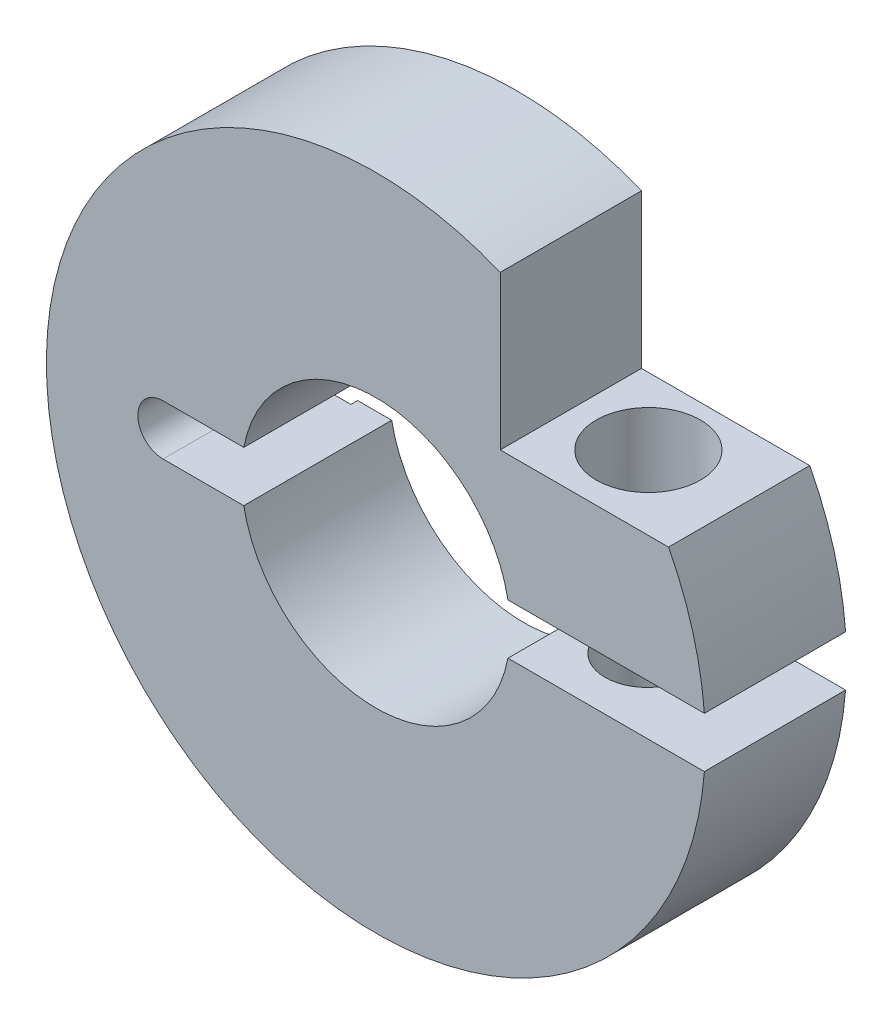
ISO-10303-21;
HEADER;
FILE_DESCRIPTION(('STEP AP214'),'2;1');
FILE_NAME('part.step','',(''),(''),'','','');
FILE_SCHEMA(('AUTOMOTIVE_DESIGN { 1 0 10303 214 1 1 1 1 }'));
ENDSEC;
DATA;
#1=APPLICATION_CONTEXT('core data for automotive mechanical design processes');
#2=APPLICATION_PROTOCOL_DEFINITION('international standard','automotive_design',2000,#1);
#3=PRODUCT_CONTEXT('',#1,'mechanical');
#4=PRODUCT('Part','Part','',(#3));
#5=PRODUCT_RELATED_PRODUCT_CATEGORY('part','',(#4));
#6=PRODUCT_DEFINITION_FORMATION('','',#4);
#7=PRODUCT_DEFINITION_CONTEXT('part definition',#1,'design');
#8=PRODUCT_DEFINITION('design','',#6,#7);
#9=PRODUCT_DEFINITION_SHAPE('','',#8);
#10=(LENGTH_UNIT() NAMED_UNIT(*) SI_UNIT(.MILLI.,.METRE.));
#11=(NAMED_UNIT(*) PLANE_ANGLE_UNIT() SI_UNIT($,.RADIAN.));
#12=(NAMED_UNIT(*) SI_UNIT($,.STERADIAN.) SOLID_ANGLE_UNIT());
#13=UNCERTAINTY_MEASURE_WITH_UNIT(LENGTH_MEASURE(1.E-05),#10,'distance_accuracy_value','');
#14=(GEOMETRIC_REPRESENTATION_CONTEXT(3) GLOBAL_UNCERTAINTY_ASSIGNED_CONTEXT((#13)) GLOBAL_UNIT_ASSIGNED_CONTEXT((#10,
#11,#12)) REPRESENTATION_CONTEXT('',''));
#15=CARTESIAN_POINT('',(0.,0.,0.));
#16=DIRECTION('',(0.,0.,1.));
#17=DIRECTION('',(1.,0.,0.));
#18=AXIS2_PLACEMENT_3D('',#15,#16,#17);
#19=CARTESIAN_POINT('',(3.7,4.5,2.2));
#20=DIRECTION('',(0.,-1.,0.));
#21=DIRECTION('',(1.,0.,0.));
#22=AXIS2_PLACEMENT_3D('',#19,#20,#21);
#23=PLANE('',#22);
#24=CARTESIAN_POINT('',(5.90574522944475,4.5,0.));
#25=DIRECTION('',(0.,1.,0.));
#26=DIRECTION('',(0.,0.,1.));
#27=AXIS2_PLACEMENT_3D('',#24,#25,#26);
#28=CIRCLE('',#27,1.54999999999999);
#29=CARTESIAN_POINT('',(5.90574522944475,4.5,1.54999999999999));
#30=VERTEX_POINT('',#29);
#31=EDGE_CURVE('E207',#30,#30,#28,.T.);
#32=ORIENTED_EDGE('',*,*,#31,.F.);
#33=EDGE_LOOP('',(#32));
#34=FACE_BOUND('',#33,.T.);
#35=DIRECTION('',(1.,0.,0.));
#36=VECTOR('',#35,1.);
#37=CARTESIAN_POINT('',(3.7,4.5,-2.));
#38=LINE('',#37,#36);
#39=CARTESIAN_POINT('',(3.7,4.5,-2.));
#40=VERTEX_POINT('',#39);
#41=CARTESIAN_POINT('',(8.70574522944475,4.49999999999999,-2.));
#42=VERTEX_POINT('',#41);
#43=EDGE_CURVE('E190',#40,#42,#38,.T.);
#44=ORIENTED_EDGE('',*,*,#43,.F.);
#45=DIRECTION('',(0.,0.,-1.));
#46=VECTOR('',#45,1.);
#47=CARTESIAN_POINT('',(3.7,4.5,2.2));
#48=LINE('',#47,#46);
#49=CARTESIAN_POINT('',(3.7,4.5,2.2));
#50=VERTEX_POINT('',#49);
#51=EDGE_CURVE('E303',#50,#40,#48,.T.);
#52=ORIENTED_EDGE('',*,*,#51,.F.);
#53=DIRECTION('',(-1.,0.,0.));
#54=VECTOR('',#53,1.);
#55=CARTESIAN_POINT('',(3.7,4.5,2.2));
#56=LINE('',#55,#54);
#57=CARTESIAN_POINT('',(8.70574522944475,4.49999999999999,2.2));
#58=VERTEX_POINT('',#57);
#59=EDGE_CURVE('E302',#58,#50,#56,.T.);
#60=ORIENTED_EDGE('',*,*,#59,.F.);
#61=DIRECTION('',(0.,0.,-1.));
#62=VECTOR('',#61,1.);
#63=CARTESIAN_POINT('',(8.70574522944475,4.49999999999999,2.2));
#64=LINE('',#63,#62);
#65=EDGE_CURVE('E298',#58,#42,#64,.T.);
#66=ORIENTED_EDGE('',*,*,#65,.T.);
#67=EDGE_LOOP('',(#44,#52,#60,#66));
#68=FACE_BOUND('',#67,.T.);
#69=ADVANCED_FACE('F51',(#34,#68),#23,.F.);
#70=CARTESIAN_POINT('',(0.,0.,2.2));
#71=DIRECTION('',(0.,0.,-1.));
#72=DIRECTION('',(-1.,0.,0.));
#73=AXIS2_PLACEMENT_3D('',#70,#71,#72);
#74=CYLINDRICAL_SURFACE('',#73,9.8);
#75=CARTESIAN_POINT('',(5.87125887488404,-7.84654823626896,1.24999999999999));
#76=CARTESIAN_POINT('',(5.9558902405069,-7.78321799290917,1.24999864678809));
#77=CARTESIAN_POINT('',(6.03958506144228,-7.7184383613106,1.24140568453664));
#78=CARTESIAN_POINT('',(6.20307899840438,-7.58767731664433,1.20805422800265));
#79=CARTESIAN_POINT('',(6.28286277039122,-7.52169237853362,1.18323680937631));
#80=CARTESIAN_POINT('',(6.44116176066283,-7.38666883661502,1.11603911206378));
#81=CARTESIAN_POINT('',(6.51931864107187,-7.31768232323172,1.07270115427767));
#82=CARTESIAN_POINT('',(6.66670206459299,-7.18365755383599,0.968450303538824));
#83=CARTESIAN_POINT('',(6.73595020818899,-7.11860995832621,0.907581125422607));
#84=CARTESIAN_POINT('',(6.8388522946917,-7.01948578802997,0.793583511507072));
#85=CARTESIAN_POINT('',(6.87618145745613,-6.98287091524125,0.745958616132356));
#86=CARTESIAN_POINT('',(6.94478003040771,-6.91464769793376,0.643311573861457));
#87=CARTESIAN_POINT('',(6.97605941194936,-6.88303113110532,0.588301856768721));
#88=CARTESIAN_POINT('',(7.02513734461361,-6.83289214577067,0.483403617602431));
#89=CARTESIAN_POINT('',(7.04438713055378,-6.81301411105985,0.434850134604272));
#90=CARTESIAN_POINT('',(7.07701704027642,-6.77911391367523,0.333849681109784));
#91=CARTESIAN_POINT('',(7.09040175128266,-6.76508717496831,0.281405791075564));
#92=CARTESIAN_POINT('',(7.11040407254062,-6.74406209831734,0.173368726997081));
#93=CARTESIAN_POINT('',(7.11696557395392,-6.73712204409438,0.117753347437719));
#94=CARTESIAN_POINT('',(7.12250049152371,-6.73127081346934,0.00573395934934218));
#95=CARTESIAN_POINT('',(7.12147833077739,-6.73235495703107,-0.0506695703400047));
#96=CARTESIAN_POINT('',(7.11257463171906,-6.74175871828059,-0.155000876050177));
#97=CARTESIAN_POINT('',(7.10557974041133,-6.74914297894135,-0.203096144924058));
#98=CARTESIAN_POINT('',(7.08639597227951,-6.76928242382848,-0.297059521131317));
#99=CARTESIAN_POINT('',(7.0742048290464,-6.78203995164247,-0.342926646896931));
#100=CARTESIAN_POINT('',(7.04060876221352,-6.81693351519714,-0.446022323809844));
#101=CARTESIAN_POINT('',(7.01749835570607,-6.84076894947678,-0.502117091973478));
#102=CARTESIAN_POINT('',(6.96492353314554,-6.89429123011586,-0.608211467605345));
#103=CARTESIAN_POINT('',(6.93544590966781,-6.92399022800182,-0.658198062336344));
#104=CARTESIAN_POINT('',(6.85946450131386,-6.99939722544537,-0.769434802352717));
#105=CARTESIAN_POINT('',(6.81071691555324,-7.04693746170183,-0.827901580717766));
#106=CARTESIAN_POINT('',(6.7060890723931,-7.14658063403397,-0.933319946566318));
#107=CARTESIAN_POINT('',(6.65020138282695,-7.19868830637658,-0.980259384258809));
#108=CARTESIAN_POINT('',(6.53118440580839,-7.30686488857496,-1.06416292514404));
#109=CARTESIAN_POINT('',(6.46789500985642,-7.36300415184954,-1.10080734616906));
#110=CARTESIAN_POINT('',(6.33667228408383,-7.47623627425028,-1.16238746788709));
#111=CARTESIAN_POINT('',(6.26873798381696,-7.53332933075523,-1.1873207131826));
#112=CARTESIAN_POINT('',(6.11439438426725,-7.65937921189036,-1.22925770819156));
#113=CARTESIAN_POINT('',(6.02713892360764,-7.72826455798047,-1.24342908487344));
#114=CARTESIAN_POINT('',(5.84960754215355,-7.86349266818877,-1.25296484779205));
#115=CARTESIAN_POINT('',(5.75933236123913,-7.92983604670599,-1.2483338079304));
#116=CARTESIAN_POINT('',(5.59594943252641,-8.0457078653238,-1.22155476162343));
#117=CARTESIAN_POINT('',(5.5228365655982,-8.09603724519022,-1.20289963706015));
#118=CARTESIAN_POINT('',(5.37881750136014,-8.19242304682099,-1.1514470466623));
#119=CARTESIAN_POINT('',(5.30790848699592,-8.23848508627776,-1.11866850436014));
#120=CARTESIAN_POINT('',(5.18151339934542,-8.31845223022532,-1.04463821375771));
#121=CARTESIAN_POINT('',(5.12532349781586,-8.3531403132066,-1.00543822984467));
#122=CARTESIAN_POINT('',(5.01858736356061,-8.41769963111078,-0.916658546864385));
#123=CARTESIAN_POINT('',(4.96804016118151,-8.44757169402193,-0.867080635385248));
#124=CARTESIAN_POINT('',(4.87461611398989,-8.50182704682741,-0.757889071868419));
#125=CARTESIAN_POINT('',(4.83178880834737,-8.52617512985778,-0.698215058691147));
#126=CARTESIAN_POINT('',(4.75659535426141,-8.56835291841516,-0.57052782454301));
#127=CARTESIAN_POINT('',(4.724222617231,-8.58618673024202,-0.502519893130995));
#128=CARTESIAN_POINT('',(4.67501455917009,-8.61306765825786,-0.368750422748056));
#129=CARTESIAN_POINT('',(4.65681009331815,-8.62289545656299,-0.30364749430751));
#130=CARTESIAN_POINT('',(4.63113419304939,-8.63671319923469,-0.170767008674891));
#131=CARTESIAN_POINT('',(4.62365698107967,-8.64070628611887,-0.102990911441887));
#132=CARTESIAN_POINT('',(4.61998529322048,-8.64266948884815,0.0278476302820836));
#133=CARTESIAN_POINT('',(4.62298772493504,-8.64106830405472,0.0908829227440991));
#134=CARTESIAN_POINT('',(4.63836908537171,-8.632821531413,0.21545087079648));
#135=CARTESIAN_POINT('',(4.65074655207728,-8.62617673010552,0.276983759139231));
#136=CARTESIAN_POINT('',(4.6841364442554,-8.60809028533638,0.396288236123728));
#137=CARTESIAN_POINT('',(4.70506953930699,-8.59669269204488,0.454088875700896));
#138=CARTESIAN_POINT('',(4.75464136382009,-8.56937469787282,0.565123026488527));
#139=CARTESIAN_POINT('',(4.78328125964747,-8.55345361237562,0.618355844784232));
#140=CARTESIAN_POINT('',(4.84867147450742,-8.51656364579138,0.721615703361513));
#141=CARTESIAN_POINT('',(4.88574876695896,-8.49538674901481,0.771360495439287));
#142=CARTESIAN_POINT('',(4.96565589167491,-8.44892870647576,0.863782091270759));
#143=CARTESIAN_POINT('',(5.00848716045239,-8.42364653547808,0.906457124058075));
#144=CARTESIAN_POINT('',(5.10299793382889,-8.36676428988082,0.988211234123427));
#145=CARTESIAN_POINT('',(5.15513411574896,-8.33478443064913,1.02649599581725));
#146=CARTESIAN_POINT('',(5.26289814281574,-8.26716135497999,1.0938195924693));
#147=CARTESIAN_POINT('',(5.31852894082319,-8.2315150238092,1.12285047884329));
#148=CARTESIAN_POINT('',(5.4400194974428,-8.15182198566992,1.17538486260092));
#149=CARTESIAN_POINT('',(5.50618674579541,-8.10730869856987,1.19746227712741));
#150=CARTESIAN_POINT('',(5.63918350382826,-8.01536856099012,1.23017337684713));
#151=CARTESIAN_POINT('',(5.70601224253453,-7.96794482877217,1.24081909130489));
#152=CARTESIAN_POINT('',(5.80549669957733,-7.89543534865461,1.24870970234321));
#153=CARTESIAN_POINT('',(5.83844817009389,-7.87110071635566,1.25000052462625));
#154=CARTESIAN_POINT('',(5.87125887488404,-7.84654823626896,1.24999999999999));
#155=B_SPLINE_CURVE_WITH_KNOTS('',3,(#75,#76,#77,#78,#79,#80,#81,#82,#83,#84,#85,#86,#87,#88,
#89,#90,#91,#92,#93,#94,#95,#96,#97,#98,#99,#100,#101,#102,#103,#104,#105,#106,#107,#108,#109,
#110,#111,#112,#113,#114,#115,#116,#117,#118,#119,#120,#121,#122,#123,#124,#125,#126,#127,#128,
#129,#130,#131,#132,#133,#134,#135,#136,#137,#138,#139,#140,#141,#142,#143,#144,#145,#146,#147,
#148,#149,#150,#151,#152,#153,#154),.UNSPECIFIED.,.T.,.F.,(4,2,2,2,2,2,2,2,2,2,2,2,2,2,2,2,2,2,
2,2,2,2,2,2,2,2,2,2,2,2,2,2,2,2,2,2,2,2,2,4),(0.,0.317004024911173,0.635165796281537,
0.972270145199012,1.30854108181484,1.52008011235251,1.7312674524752,1.89828723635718,
2.06517615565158,2.23342684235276,2.40157940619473,2.54839975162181,2.6952842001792,
2.88975870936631,3.0846405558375,3.35243811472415,3.6205167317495,3.89617745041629,
4.17189593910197,4.50652354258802,4.84106974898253,5.11209595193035,5.38276013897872,
5.6121876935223,5.84157576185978,6.07238713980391,6.30305277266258,6.50689179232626,
6.71062098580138,6.89909161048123,7.08753284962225,7.27426507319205,7.46102557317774,
7.6568785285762,7.85278047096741,8.0684010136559,8.28420626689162,8.53152311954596,
8.77857947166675,8.90147865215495),.UNSPECIFIED.);
#156=CARTESIAN_POINT('',(5.87125887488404,-7.84654823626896,1.24999999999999));
#157=VERTEX_POINT('',#156);
#158=EDGE_CURVE('E200',#157,#157,#155,.T.);
#159=ORIENTED_EDGE('',*,*,#158,.T.);
#160=EDGE_LOOP('',(#159));
#161=FACE_BOUND('',#160,.T.);
#162=CARTESIAN_POINT('',(0.,0.,-2.));
#163=DIRECTION('',(0.,0.,-1.));
#164=DIRECTION('',(-1.,0.,0.));
#165=AXIS2_PLACEMENT_3D('',#162,#163,#164);
#166=CIRCLE('',#165,9.8);
#167=CARTESIAN_POINT('',(9.77125887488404,-0.750000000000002,-2.));
#168=VERTEX_POINT('',#167);
#169=CARTESIAN_POINT('',(3.7,9.07469007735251,-2.));
#170=VERTEX_POINT('',#169);
#171=EDGE_CURVE('E178',#168,#170,#166,.T.);
#172=ORIENTED_EDGE('',*,*,#171,.F.);
#173=DIRECTION('',(0.,0.,-1.));
#174=VECTOR('',#173,1.);
#175=CARTESIAN_POINT('',(9.77125887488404,-0.750000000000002,2.2));
#176=LINE('',#175,#174);
#177=CARTESIAN_POINT('',(9.77125887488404,-0.750000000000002,2.2));
#178=VERTEX_POINT('',#177);
#179=EDGE_CURVE('E275',#178,#168,#176,.T.);
#180=ORIENTED_EDGE('',*,*,#179,.F.);
#181=CARTESIAN_POINT('',(0.,0.,2.2));
#182=DIRECTION('',(0.,0.,1.));
#183=DIRECTION('',(1.,0.,0.));
#184=AXIS2_PLACEMENT_3D('',#181,#182,#183);
#185=CIRCLE('',#184,9.8);
#186=CARTESIAN_POINT('',(3.7,9.07469007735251,2.2));
#187=VERTEX_POINT('',#186);
#188=EDGE_CURVE('E347',#187,#178,#185,.T.);
#189=ORIENTED_EDGE('',*,*,#188,.F.);
#190=DIRECTION('',(0.,0.,-1.));
#191=VECTOR('',#190,1.);
#192=CARTESIAN_POINT('',(3.7,9.07469007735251,2.2));
#193=LINE('',#192,#191);
#194=EDGE_CURVE('E282',#187,#170,#193,.T.);
#195=ORIENTED_EDGE('',*,*,#194,.T.);
#196=EDGE_LOOP('',(#172,#180,#189,#195));
#197=FACE_BOUND('',#196,.T.);
#198=ADVANCED_FACE('F53',(#161,#197),#74,.T.);
#199=CARTESIAN_POINT('',(3.92905841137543,-0.750000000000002,2.2));
#200=DIRECTION('',(0.,-1.,0.));
#201=DIRECTION('',(1.,0.,0.));
#202=AXIS2_PLACEMENT_3D('',#199,#200,#201);
#203=PLANE('',#202);
#204=CARTESIAN_POINT('',(5.87125887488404,-0.749999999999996,0.));
#205=DIRECTION('',(0.,1.,0.));
#206=DIRECTION('',(0.,0.,1.));
#207=AXIS2_PLACEMENT_3D('',#204,#205,#206);
#208=CIRCLE('',#207,1.24999999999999);
#209=CARTESIAN_POINT('',(5.87125887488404,-0.749999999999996,1.24999999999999));
#210=VERTEX_POINT('',#209);
#211=EDGE_CURVE('E197',#210,#210,#208,.T.);
#212=ORIENTED_EDGE('',*,*,#211,.F.);
#213=EDGE_LOOP('',(#212));
#214=FACE_BOUND('',#213,.T.);
#215=DIRECTION('',(1.,0.,0.));
#216=VECTOR('',#215,1.);
#217=CARTESIAN_POINT('',(3.92905841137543,-0.750000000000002,-2.));
#218=LINE('',#217,#216);
#219=CARTESIAN_POINT('',(4.9434299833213,-0.750000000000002,-2.));
#220=VERTEX_POINT('',#219);
#221=EDGE_CURVE('E195',#220,#168,#218,.T.);
#222=ORIENTED_EDGE('',*,*,#221,.F.);
#223=DIRECTION('',(0.,0.,-1.));
#224=VECTOR('',#223,1.);
#225=CARTESIAN_POINT('',(4.9434299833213,-0.750000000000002,-2.));
#226=LINE('',#225,#224);
#227=CARTESIAN_POINT('',(4.9434299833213,-0.750000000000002,-2.2));
#228=VERTEX_POINT('',#227);
#229=EDGE_CURVE('E272',#228,#220,#226,.F.);
#230=ORIENTED_EDGE('',*,*,#229,.F.);
#231=DIRECTION('',(-1.,0.,0.));
#232=VECTOR('',#231,1.);
#233=CARTESIAN_POINT('',(3.92905841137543,-0.750000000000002,-2.2));
#234=LINE('',#233,#232);
#235=CARTESIAN_POINT('',(3.92905841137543,-0.750000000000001,-2.2));
#236=VERTEX_POINT('',#235);
#237=EDGE_CURVE('E330',#228,#236,#234,.T.);
#238=ORIENTED_EDGE('',*,*,#237,.T.);
#239=DIRECTION('',(0.,0.,-1.));
#240=VECTOR('',#239,1.);
#241=CARTESIAN_POINT('',(3.92905841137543,-0.750000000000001,2.2));
#242=LINE('',#241,#240);
#243=CARTESIAN_POINT('',(3.92905841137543,-0.750000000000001,2.2));
#244=VERTEX_POINT('',#243);
#245=EDGE_CURVE('E320',#244,#236,#242,.T.);
#246=ORIENTED_EDGE('',*,*,#245,.F.);
#247=DIRECTION('',(-1.,0.,0.));
#248=VECTOR('',#247,1.);
#249=CARTESIAN_POINT('',(3.92905841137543,-0.750000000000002,2.2));
#250=LINE('',#249,#248);
#251=EDGE_CURVE('E349',#178,#244,#250,.T.);
#252=ORIENTED_EDGE('',*,*,#251,.F.);
#253=ORIENTED_EDGE('',*,*,#179,.T.);
#254=EDGE_LOOP('',(#222,#230,#238,#246,#252,#253));
#255=FACE_BOUND('',#254,.T.);
#256=ADVANCED_FACE('F257',(#214,#255),#203,.F.);
#257=CARTESIAN_POINT('',(-3.92905841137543,-0.750000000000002,2.2));
#258=DIRECTION('',(0.,-1.,0.));
#259=DIRECTION('',(1.,0.,0.));
#260=AXIS2_PLACEMENT_3D('',#257,#258,#259);
#261=PLANE('',#260);
#262=DIRECTION('',(1.,0.,0.));
#263=VECTOR('',#262,1.);
#264=CARTESIAN_POINT('',(-3.92905841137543,-0.750000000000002,-2.));
#265=LINE('',#264,#263);
#266=CARTESIAN_POINT('',(-6.32905841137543,-0.750000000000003,-2.));
#267=VERTEX_POINT('',#266);
#268=CARTESIAN_POINT('',(-4.9434299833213,-0.750000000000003,-2.));
#269=VERTEX_POINT('',#268);
#270=EDGE_CURVE('E188',#267,#269,#265,.T.);
#271=ORIENTED_EDGE('',*,*,#270,.F.);
#272=DIRECTION('',(0.,0.,-1.));
#273=VECTOR('',#272,1.);
#274=CARTESIAN_POINT('',(-6.32905841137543,-0.750000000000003,2.2));
#275=LINE('',#274,#273);
#276=CARTESIAN_POINT('',(-6.32905841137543,-0.750000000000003,2.2));
#277=VERTEX_POINT('',#276);
#278=EDGE_CURVE('E315',#277,#267,#275,.T.);
#279=ORIENTED_EDGE('',*,*,#278,.F.);
#280=DIRECTION('',(-1.,0.,0.));
#281=VECTOR('',#280,1.);
#282=CARTESIAN_POINT('',(-3.92905841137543,-0.750000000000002,2.2));
#283=LINE('',#282,#281);
#284=CARTESIAN_POINT('',(-3.92905841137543,-0.750000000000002,2.2));
#285=VERTEX_POINT('',#284);
#286=EDGE_CURVE('E353',#285,#277,#283,.T.);
#287=ORIENTED_EDGE('',*,*,#286,.F.);
#288=DIRECTION('',(0.,0.,-1.));
#289=VECTOR('',#288,1.);
#290=CARTESIAN_POINT('',(-3.92905841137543,-0.750000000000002,2.2));
#291=LINE('',#290,#289);
#292=CARTESIAN_POINT('',(-3.92905841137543,-0.750000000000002,-2.2));
#293=VERTEX_POINT('',#292);
#294=EDGE_CURVE('E318',#285,#293,#291,.T.);
#295=ORIENTED_EDGE('',*,*,#294,.T.);
#296=DIRECTION('',(-1.,0.,0.));
#297=VECTOR('',#296,1.);
#298=CARTESIAN_POINT('',(-3.92905841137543,-0.750000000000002,-2.2));
#299=LINE('',#298,#297);
#300=CARTESIAN_POINT('',(-4.9434299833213,-0.750000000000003,-2.2));
#301=VERTEX_POINT('',#300);
#302=EDGE_CURVE('E328',#293,#301,#299,.T.);
#303=ORIENTED_EDGE('',*,*,#302,.T.);
#304=DIRECTION('',(0.,0.,-1.));
#305=VECTOR('',#304,1.);
#306=CARTESIAN_POINT('',(-4.9434299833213,-0.750000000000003,-2.));
#307=LINE('',#306,#305);
#308=EDGE_CURVE('E67',#269,#301,#307,.T.);
#309=ORIENTED_EDGE('',*,*,#308,.F.);
#310=EDGE_LOOP('',(#271,#279,#287,#295,#303,#309));
#311=FACE_BOUND('',#310,.T.);
#312=ADVANCED_FACE('F253',(#311),#261,.F.);
#313=CARTESIAN_POINT('',(-6.32905841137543,0.,2.2));
#314=DIRECTION('',(0.,0.,-1.));
#315=DIRECTION('',(-1.,0.,0.));
#316=AXIS2_PLACEMENT_3D('',#313,#314,#315);
#317=CYLINDRICAL_SURFACE('',#316,0.75);
#318=CARTESIAN_POINT('',(-6.32905841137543,0.,-2.));
#319=DIRECTION('',(0.,0.,-1.));
#320=DIRECTION('',(-1.,0.,0.));
#321=AXIS2_PLACEMENT_3D('',#318,#319,#320);
#322=CIRCLE('',#321,0.75);
#323=CARTESIAN_POINT('',(-6.32905841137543,0.749999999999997,-2.));
#324=VERTEX_POINT('',#323);
#325=EDGE_CURVE('E186',#324,#267,#322,.F.);
#326=ORIENTED_EDGE('',*,*,#325,.F.);
#327=DIRECTION('',(0.,0.,-1.));
#328=VECTOR('',#327,1.);
#329=CARTESIAN_POINT('',(-6.32905841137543,0.749999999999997,2.2));
#330=LINE('',#329,#328);
#331=CARTESIAN_POINT('',(-6.32905841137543,0.749999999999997,2.2));
#332=VERTEX_POINT('',#331);
#333=EDGE_CURVE('E185',#332,#324,#330,.T.);
#334=ORIENTED_EDGE('',*,*,#333,.F.);
#335=CARTESIAN_POINT('',(-6.32905841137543,0.,2.2));
#336=DIRECTION('',(0.,0.,-1.));
#337=DIRECTION('',(1.,0.,0.));
#338=AXIS2_PLACEMENT_3D('',#335,#336,#337);
#339=CIRCLE('',#338,0.75);
#340=EDGE_CURVE('E355',#277,#332,#339,.T.);
#341=ORIENTED_EDGE('',*,*,#340,.F.);
#342=ORIENTED_EDGE('',*,*,#278,.T.);
#343=EDGE_LOOP('',(#326,#334,#341,#342));
#344=FACE_BOUND('',#343,.T.);
#345=ADVANCED_FACE('F250',(#344),#317,.F.);
#346=CARTESIAN_POINT('',(-3.92905841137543,0.749999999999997,2.2));
#347=DIRECTION('',(0.,1.,0.));
#348=DIRECTION('',(0.,0.,1.));
#349=AXIS2_PLACEMENT_3D('',#346,#347,#348);
#350=PLANE('',#349);
#351=DIRECTION('',(-1.,0.,0.));
#352=VECTOR('',#351,1.);
#353=CARTESIAN_POINT('',(-3.92905841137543,0.749999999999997,-2.));
#354=LINE('',#353,#352);
#355=CARTESIAN_POINT('',(-4.9434299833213,0.749999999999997,-2.));
#356=VERTEX_POINT('',#355);
#357=EDGE_CURVE('E174',#356,#324,#354,.T.);
#358=ORIENTED_EDGE('',*,*,#357,.F.);
#359=DIRECTION('',(0.,0.,-1.));
#360=VECTOR('',#359,1.);
#361=CARTESIAN_POINT('',(-4.9434299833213,0.749999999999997,-2.));
#362=LINE('',#361,#360);
#363=CARTESIAN_POINT('',(-4.9434299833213,0.749999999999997,-2.2));
#364=VERTEX_POINT('',#363);
#365=EDGE_CURVE('E160',#364,#356,#362,.F.);
#366=ORIENTED_EDGE('',*,*,#365,.F.);
#367=DIRECTION('',(1.,0.,0.));
#368=VECTOR('',#367,1.);
#369=CARTESIAN_POINT('',(-3.92905841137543,0.749999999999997,-2.2));
#370=LINE('',#369,#368);
#371=CARTESIAN_POINT('',(-3.92905841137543,0.749999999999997,-2.2));
#372=VERTEX_POINT('',#371);
#373=EDGE_CURVE('E334',#364,#372,#370,.T.);
#374=ORIENTED_EDGE('',*,*,#373,.T.);
#375=DIRECTION('',(0.,0.,-1.));
#376=VECTOR('',#375,1.);
#377=CARTESIAN_POINT('',(-3.92905841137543,0.749999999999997,2.2));
#378=LINE('',#377,#376);
#379=CARTESIAN_POINT('',(-3.92905841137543,0.749999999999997,2.2));
#380=VERTEX_POINT('',#379);
#381=EDGE_CURVE('E311',#380,#372,#378,.T.);
#382=ORIENTED_EDGE('',*,*,#381,.F.);
#383=DIRECTION('',(1.,0.,0.));
#384=VECTOR('',#383,1.);
#385=CARTESIAN_POINT('',(-3.92905841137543,0.749999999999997,2.2));
#386=LINE('',#385,#384);
#387=EDGE_CURVE('E357',#332,#380,#386,.T.);
#388=ORIENTED_EDGE('',*,*,#387,.F.);
#389=ORIENTED_EDGE('',*,*,#333,.T.);
#390=EDGE_LOOP('',(#358,#366,#374,#382,#388,#389));
#391=FACE_BOUND('',#390,.T.);
#392=ADVANCED_FACE('F182',(#391),#350,.F.);
#393=CARTESIAN_POINT('',(3.92905841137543,0.749999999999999,2.2));
#394=DIRECTION('',(0.,1.,0.));
#395=DIRECTION('',(-1.,0.,0.));
#396=AXIS2_PLACEMENT_3D('',#393,#394,#395);
#397=PLANE('',#396);
#398=CARTESIAN_POINT('',(5.90574522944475,0.749999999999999,0.));
#399=DIRECTION('',(0.,1.,0.));
#400=DIRECTION('',(-1.,0.,0.));
#401=AXIS2_PLACEMENT_3D('',#398,#399,#400);
#402=CIRCLE('',#401,1.54999999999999);
#403=CARTESIAN_POINT('',(4.35574522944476,0.749999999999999,0.));
#404=VERTEX_POINT('',#403);
#405=EDGE_CURVE('E377',#404,#404,#402,.T.);
#406=ORIENTED_EDGE('',*,*,#405,.T.);
#407=EDGE_LOOP('',(#406));
#408=FACE_BOUND('',#407,.T.);
#409=DIRECTION('',(-1.,0.,0.));
#410=VECTOR('',#409,1.);
#411=CARTESIAN_POINT('',(3.92905841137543,0.749999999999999,-2.));
#412=LINE('',#411,#410);
#413=CARTESIAN_POINT('',(9.77125887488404,0.75,-2.));
#414=VERTEX_POINT('',#413);
#415=CARTESIAN_POINT('',(4.9434299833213,0.749999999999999,-2.));
#416=VERTEX_POINT('',#415);
#417=EDGE_CURVE('E177',#414,#416,#412,.T.);
#418=ORIENTED_EDGE('',*,*,#417,.F.);
#419=DIRECTION('',(0.,0.,-1.));
#420=VECTOR('',#419,1.);
#421=CARTESIAN_POINT('',(9.77125887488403,0.75,2.2));
#422=LINE('',#421,#420);
#423=CARTESIAN_POINT('',(9.77125887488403,0.75,2.2));
#424=VERTEX_POINT('',#423);
#425=EDGE_CURVE('E301',#424,#414,#422,.T.);
#426=ORIENTED_EDGE('',*,*,#425,.F.);
#427=DIRECTION('',(1.,0.,0.));
#428=VECTOR('',#427,1.);
#429=CARTESIAN_POINT('',(3.92905841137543,0.749999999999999,2.2));
#430=LINE('',#429,#428);
#431=CARTESIAN_POINT('',(3.92905841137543,0.749999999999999,2.2));
#432=VERTEX_POINT('',#431);
#433=EDGE_CURVE('E361',#432,#424,#430,.T.);
#434=ORIENTED_EDGE('',*,*,#433,.F.);
#435=DIRECTION('',(0.,0.,-1.));
#436=VECTOR('',#435,1.);
#437=CARTESIAN_POINT('',(3.92905841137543,0.749999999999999,2.2));
#438=LINE('',#437,#436);
#439=CARTESIAN_POINT('',(3.92905841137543,0.749999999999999,-2.2));
#440=VERTEX_POINT('',#439);
#441=EDGE_CURVE('E305',#432,#440,#438,.T.);
#442=ORIENTED_EDGE('',*,*,#441,.T.);
#443=DIRECTION('',(1.,0.,0.));
#444=VECTOR('',#443,1.);
#445=CARTESIAN_POINT('',(3.92905841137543,0.749999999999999,-2.2));
#446=LINE('',#445,#444);
#447=CARTESIAN_POINT('',(4.9434299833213,0.749999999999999,-2.2));
#448=VERTEX_POINT('',#447);
#449=EDGE_CURVE('E344',#440,#448,#446,.T.);
#450=ORIENTED_EDGE('',*,*,#449,.T.);
#451=DIRECTION('',(0.,0.,-1.));
#452=VECTOR('',#451,1.);
#453=CARTESIAN_POINT('',(4.9434299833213,0.749999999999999,-2.));
#454=LINE('',#453,#452);
#455=EDGE_CURVE('E170',#416,#448,#454,.T.);
#456=ORIENTED_EDGE('',*,*,#455,.F.);
#457=EDGE_LOOP('',(#418,#426,#434,#442,#450,#456));
#458=FACE_BOUND('',#457,.T.);
#459=ADVANCED_FACE('F239',(#408,#458),#397,.F.);
#460=CARTESIAN_POINT('',(0.,0.,2.2));
#461=DIRECTION('',(0.,0.,-1.));
#462=DIRECTION('',(-1.,0.,0.));
#463=AXIS2_PLACEMENT_3D('',#460,#461,#462);
#464=CYLINDRICAL_SURFACE('',#463,9.8);
#465=EDGE_CURVE('E283',#42,#414,#166,.T.);
#466=ORIENTED_EDGE('',*,*,#465,.F.);
#467=ORIENTED_EDGE('',*,*,#65,.F.);
#468=CARTESIAN_POINT('',(0.,0.,2.2));
#469=DIRECTION('',(0.,0.,1.));
#470=DIRECTION('',(1.,0.,0.));
#471=AXIS2_PLACEMENT_3D('',#468,#469,#470);
#472=CIRCLE('',#471,9.8);
#473=EDGE_CURVE('E363',#424,#58,#472,.T.);
#474=ORIENTED_EDGE('',*,*,#473,.F.);
#475=ORIENTED_EDGE('',*,*,#425,.T.);
#476=EDGE_LOOP('',(#466,#467,#474,#475));
#477=FACE_BOUND('',#476,.T.);
#478=ADVANCED_FACE('F232',(#477),#464,.T.);
#479=CARTESIAN_POINT('',(3.7,9.07469007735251,2.2));
#480=DIRECTION('',(-1.,0.,0.));
#481=DIRECTION('',(0.,-1.,0.));
#482=AXIS2_PLACEMENT_3D('',#479,#480,#481);
#483=PLANE('',#482);
#484=DIRECTION('',(0.,-1.,0.));
#485=VECTOR('',#484,1.);
#486=CARTESIAN_POINT('',(3.7,9.07469007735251,-2.));
#487=LINE('',#486,#485);
#488=EDGE_CURVE('E12',#170,#40,#487,.T.);
#489=ORIENTED_EDGE('',*,*,#488,.F.);
#490=ORIENTED_EDGE('',*,*,#194,.F.);
#491=DIRECTION('',(0.,1.,0.));
#492=VECTOR('',#491,1.);
#493=CARTESIAN_POINT('',(3.7,9.07469007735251,2.2));
#494=LINE('',#493,#492);
#495=EDGE_CURVE('E75',#50,#187,#494,.T.);
#496=ORIENTED_EDGE('',*,*,#495,.F.);
#497=ORIENTED_EDGE('',*,*,#51,.T.);
#498=EDGE_LOOP('',(#489,#490,#496,#497));
#499=FACE_BOUND('',#498,.T.);
#500=ADVANCED_FACE('F225',(#499),#483,.F.);
#501=CARTESIAN_POINT('',(0.,0.,-2.2));
#502=DIRECTION('',(0.,0.,1.));
#503=DIRECTION('',(1.,0.,0.));
#504=AXIS2_PLACEMENT_3D('',#501,#502,#503);
#505=PLANE('',#504);
#506=CARTESIAN_POINT('',(0.,0.,-2.2));
#507=DIRECTION('',(0.,0.,-1.));
#508=DIRECTION('',(-1.,0.,0.));
#509=AXIS2_PLACEMENT_3D('',#506,#507,#508);
#510=CIRCLE('',#509,5.);
#511=EDGE_CURVE('E166',#364,#448,#510,.T.);
#512=ORIENTED_EDGE('',*,*,#511,.T.);
#513=ORIENTED_EDGE('',*,*,#449,.F.);
#514=CARTESIAN_POINT('',(0.,0.,-2.2));
#515=DIRECTION('',(0.,0.,-1.));
#516=DIRECTION('',(1.,0.,0.));
#517=AXIS2_PLACEMENT_3D('',#514,#515,#516);
#518=CIRCLE('',#517,4.);
#519=EDGE_CURVE('E337',#372,#440,#518,.T.);
#520=ORIENTED_EDGE('',*,*,#519,.F.);
#521=ORIENTED_EDGE('',*,*,#373,.F.);
#522=EDGE_LOOP('',(#512,#513,#520,#521));
#523=FACE_BOUND('',#522,.T.);
#524=ADVANCED_FACE('F221',(#523),#505,.F.);
#525=CARTESIAN_POINT('',(0.,0.,-2.2));
#526=DIRECTION('',(0.,0.,1.));
#527=DIRECTION('',(1.,0.,0.));
#528=AXIS2_PLACEMENT_3D('',#525,#526,#527);
#529=CIRCLE('',#528,5.);
#530=EDGE_CURVE('E60',#301,#228,#529,.T.);
#531=ORIENTED_EDGE('',*,*,#530,.F.);
#532=ORIENTED_EDGE('',*,*,#302,.F.);
#533=CARTESIAN_POINT('',(0.,0.,-2.2));
#534=DIRECTION('',(0.,0.,-1.));
#535=DIRECTION('',(1.,0.,0.));
#536=AXIS2_PLACEMENT_3D('',#533,#534,#535);
#537=CIRCLE('',#536,4.);
#538=EDGE_CURVE('E335',#236,#293,#537,.T.);
#539=ORIENTED_EDGE('',*,*,#538,.F.);
#540=ORIENTED_EDGE('',*,*,#237,.F.);
#541=EDGE_LOOP('',(#531,#532,#539,#540));
#542=FACE_BOUND('',#541,.T.);
#543=ADVANCED_FACE('F224',(#542),#505,.F.);
#544=CARTESIAN_POINT('',(0.,0.,2.2));
#545=DIRECTION('',(0.,0.,-1.));
#546=DIRECTION('',(-1.,0.,0.));
#547=AXIS2_PLACEMENT_3D('',#544,#545,#546);
#548=CYLINDRICAL_SURFACE('',#547,4.);
#549=ORIENTED_EDGE('',*,*,#245,.T.);
#550=ORIENTED_EDGE('',*,*,#538,.T.);
#551=ORIENTED_EDGE('',*,*,#294,.F.);
#552=CARTESIAN_POINT('',(0.,0.,2.2));
#553=DIRECTION('',(0.,0.,-1.));
#554=DIRECTION('',(1.,0.,0.));
#555=AXIS2_PLACEMENT_3D('',#552,#553,#554);
#556=CIRCLE('',#555,4.);
#557=EDGE_CURVE('E351',#244,#285,#556,.T.);
#558=ORIENTED_EDGE('',*,*,#557,.F.);
#559=EDGE_LOOP('',(#549,#550,#551,#558));
#560=FACE_BOUND('',#559,.T.);
#561=ADVANCED_FACE('F246',(#560),#548,.F.);
#562=CARTESIAN_POINT('',(0.,0.,2.2));
#563=DIRECTION('',(0.,0.,-1.));
#564=DIRECTION('',(-1.,0.,0.));
#565=AXIS2_PLACEMENT_3D('',#562,#563,#564);
#566=CYLINDRICAL_SURFACE('',#565,4.);
#567=ORIENTED_EDGE('',*,*,#381,.T.);
#568=ORIENTED_EDGE('',*,*,#519,.T.);
#569=ORIENTED_EDGE('',*,*,#441,.F.);
#570=CARTESIAN_POINT('',(0.,0.,2.2));
#571=DIRECTION('',(0.,0.,-1.));
#572=DIRECTION('',(1.,0.,0.));
#573=AXIS2_PLACEMENT_3D('',#570,#571,#572);
#574=CIRCLE('',#573,4.);
#575=EDGE_CURVE('E359',#380,#432,#574,.T.);
#576=ORIENTED_EDGE('',*,*,#575,.F.);
#577=EDGE_LOOP('',(#567,#568,#569,#576));
#578=FACE_BOUND('',#577,.T.);
#579=ADVANCED_FACE('F229',(#578),#566,.F.);
#580=CARTESIAN_POINT('',(0.,0.,2.2));
#581=DIRECTION('',(0.,0.,1.));
#582=DIRECTION('',(1.,0.,0.));
#583=AXIS2_PLACEMENT_3D('',#580,#581,#582);
#584=PLANE('',#583);
#585=ORIENTED_EDGE('',*,*,#188,.T.);
#586=ORIENTED_EDGE('',*,*,#251,.T.);
#587=ORIENTED_EDGE('',*,*,#557,.T.);
#588=ORIENTED_EDGE('',*,*,#286,.T.);
#589=ORIENTED_EDGE('',*,*,#340,.T.);
#590=ORIENTED_EDGE('',*,*,#387,.T.);
#591=ORIENTED_EDGE('',*,*,#575,.T.);
#592=ORIENTED_EDGE('',*,*,#433,.T.);
#593=ORIENTED_EDGE('',*,*,#473,.T.);
#594=ORIENTED_EDGE('',*,*,#59,.T.);
#595=ORIENTED_EDGE('',*,*,#495,.T.);
#596=EDGE_LOOP('',(#585,#586,#587,#588,#589,#590,#591,#592,#593,#594,#595));
#597=FACE_BOUND('',#596,.T.);
#598=ADVANCED_FACE('F219',(#597),#584,.T.);
#599=CARTESIAN_POINT('',(5.90574522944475,4.5,0.));
#600=DIRECTION('',(0.,1.,0.));
#601=DIRECTION('',(0.,0.,1.));
#602=AXIS2_PLACEMENT_3D('',#599,#600,#601);
#603=CYLINDRICAL_SURFACE('',#602,1.54999999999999);
#604=ORIENTED_EDGE('',*,*,#405,.F.);
#605=EDGE_LOOP('',(#604));
#606=FACE_BOUND('',#605,.T.);
#607=ORIENTED_EDGE('',*,*,#31,.T.);
#608=EDGE_LOOP('',(#607));
#609=FACE_BOUND('',#608,.T.);
#610=ADVANCED_FACE('F214',(#606,#609),#603,.F.);
#611=CARTESIAN_POINT('',(5.87125887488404,-0.749999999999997,0.));
#612=DIRECTION('',(0.,1.,0.));
#613=DIRECTION('',(0.,0.,1.));
#614=AXIS2_PLACEMENT_3D('',#611,#612,#613);
#615=CYLINDRICAL_SURFACE('',#614,1.24999999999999);
#616=ORIENTED_EDGE('',*,*,#211,.T.);
#617=EDGE_LOOP('',(#616));
#618=FACE_BOUND('',#617,.T.);
#619=ORIENTED_EDGE('',*,*,#158,.F.);
#620=EDGE_LOOP('',(#619));
#621=FACE_BOUND('',#620,.T.);
#622=ADVANCED_FACE('F209',(#618,#621),#615,.F.);
#623=CARTESIAN_POINT('',(0.,0.,-2.));
#624=DIRECTION('',(0.,0.,-1.));
#625=DIRECTION('',(-1.,0.,0.));
#626=AXIS2_PLACEMENT_3D('',#623,#624,#625);
#627=PLANE('',#626);
#628=ORIENTED_EDGE('',*,*,#221,.T.);
#629=ORIENTED_EDGE('',*,*,#171,.T.);
#630=ORIENTED_EDGE('',*,*,#488,.T.);
#631=ORIENTED_EDGE('',*,*,#43,.T.);
#632=ORIENTED_EDGE('',*,*,#465,.T.);
#633=ORIENTED_EDGE('',*,*,#417,.T.);
#634=CARTESIAN_POINT('',(0.,0.,-2.));
#635=DIRECTION('',(0.,0.,-1.));
#636=DIRECTION('',(-1.,0.,0.));
#637=AXIS2_PLACEMENT_3D('',#634,#635,#636);
#638=CIRCLE('',#637,5.);
#639=EDGE_CURVE('E163',#356,#416,#638,.T.);
#640=ORIENTED_EDGE('',*,*,#639,.F.);
#641=ORIENTED_EDGE('',*,*,#357,.T.);
#642=ORIENTED_EDGE('',*,*,#325,.T.);
#643=ORIENTED_EDGE('',*,*,#270,.T.);
#644=EDGE_CURVE('E179',#220,#269,#638,.T.);
#645=ORIENTED_EDGE('',*,*,#644,.F.);
#646=EDGE_LOOP('',(#628,#629,#630,#631,#632,#633,#640,#641,#642,#643,#645));
#647=FACE_BOUND('',#646,.T.);
#648=ADVANCED_FACE('F173',(#647),#627,.T.);
#649=CARTESIAN_POINT('',(0.,0.,-2.));
#650=DIRECTION('',(0.,0.,-1.));
#651=DIRECTION('',(-1.,0.,0.));
#652=AXIS2_PLACEMENT_3D('',#649,#650,#651);
#653=CYLINDRICAL_SURFACE('',#652,5.);
#654=ORIENTED_EDGE('',*,*,#229,.T.);
#655=ORIENTED_EDGE('',*,*,#644,.T.);
#656=ORIENTED_EDGE('',*,*,#308,.T.);
#657=ORIENTED_EDGE('',*,*,#530,.T.);
#658=EDGE_LOOP('',(#654,#655,#656,#657));
#659=FACE_BOUND('',#658,.T.);
#660=ADVANCED_FACE('F323',(#659),#653,.T.);
#661=ORIENTED_EDGE('',*,*,#365,.T.);
#662=ORIENTED_EDGE('',*,*,#639,.T.);
#663=ORIENTED_EDGE('',*,*,#455,.T.);
#664=ORIENTED_EDGE('',*,*,#511,.F.);
#665=EDGE_LOOP('',(#661,#662,#663,#664));
#666=FACE_BOUND('',#665,.T.);
#667=ADVANCED_FACE('F162',(#666),#653,.T.);
#668=CLOSED_SHELL('',(#69,#198,#256,#312,#345,#392,#459,#478,#500,#524,#543,#561,#579,#598,#610,
#622,#648,#660,#667));
#669=MANIFOLD_SOLID_BREP('B2',#668);
#670=ADVANCED_BREP_SHAPE_REPRESENTATION('',(#18,#669),#14);
#671=SHAPE_DEFINITION_REPRESENTATION(#9,#670);
ENDSEC;
END-ISO-10303-21;
